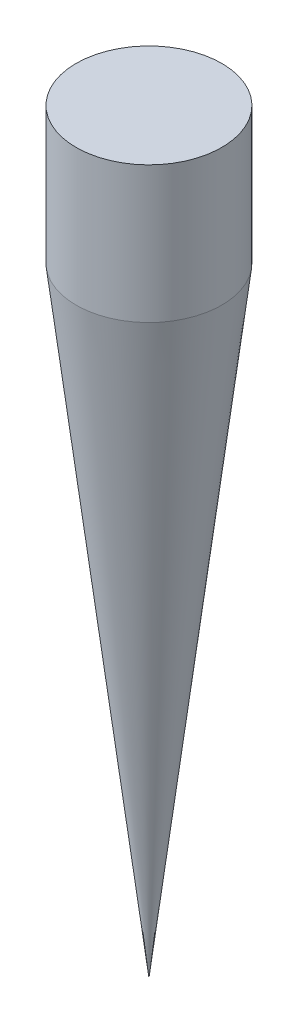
from build123d import *

# Parameters (mm, degrees)
SKETCH3_R           = 4
BOSS_EXTRUDE1_DEPTH = 7.5


with BuildPart() as part:
    # Sketch1 → Revolve1 (revolve)
    with BuildSketch(Plane.XY, mode=Mode.PRIVATE) as revolve1_sk:
        Polygon((0, 0), (0, -34), (4, 0), align=None)
    revolve(revolve1_sk.sketch.rotate(Axis((0, 0, 0), (0, -1, 0)), 180), axis=Axis((0, 0, 0), (0, -1, 0)))

    # Sketch3 → Boss-Extrude1 (add)
    with BuildSketch(Plane(origin=(0, 0, 0), x_dir=(1, 0, 0), z_dir=(0, 1, 0))):
        with Locations(Location((0, 0, 0), (0, 0, 180))):
            Circle(SKETCH3_R)
    extrude(amount=BOSS_EXTRUDE1_DEPTH)


solid = part.part
